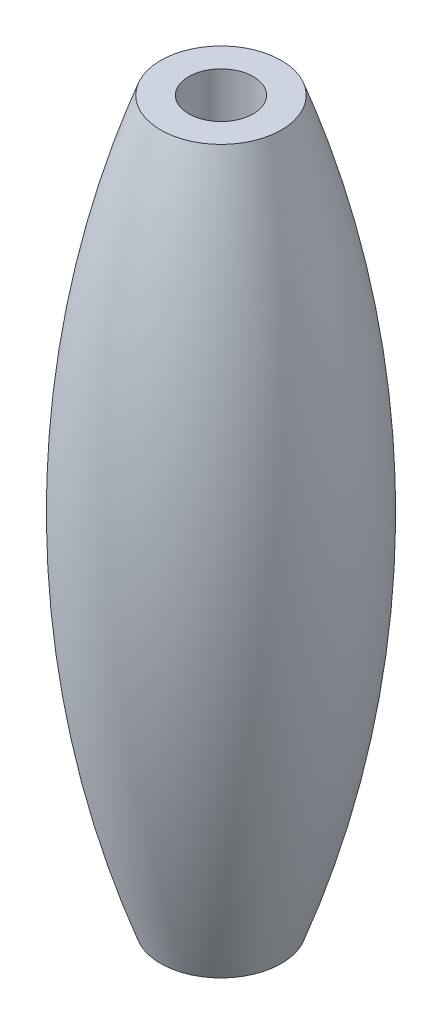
ISO-10303-21;
HEADER;
FILE_DESCRIPTION(('STEP AP214'),'2;1');
FILE_NAME('part.step','',(''),(''),'','','');
FILE_SCHEMA(('AUTOMOTIVE_DESIGN { 1 0 10303 214 1 1 1 1 }'));
ENDSEC;
DATA;
#1=APPLICATION_CONTEXT('core data for automotive mechanical design processes');
#2=APPLICATION_PROTOCOL_DEFINITION('international standard','automotive_design',2000,#1);
#3=PRODUCT_CONTEXT('',#1,'mechanical');
#4=PRODUCT('Part','Part','',(#3));
#5=PRODUCT_RELATED_PRODUCT_CATEGORY('part','',(#4));
#6=PRODUCT_DEFINITION_FORMATION('','',#4);
#7=PRODUCT_DEFINITION_CONTEXT('part definition',#1,'design');
#8=PRODUCT_DEFINITION('design','',#6,#7);
#9=PRODUCT_DEFINITION_SHAPE('','',#8);
#10=(LENGTH_UNIT() NAMED_UNIT(*) SI_UNIT(.MILLI.,.METRE.));
#11=(NAMED_UNIT(*) PLANE_ANGLE_UNIT() SI_UNIT($,.RADIAN.));
#12=(NAMED_UNIT(*) SI_UNIT($,.STERADIAN.) SOLID_ANGLE_UNIT());
#13=UNCERTAINTY_MEASURE_WITH_UNIT(LENGTH_MEASURE(1.E-05),#10,'distance_accuracy_value','');
#14=(GEOMETRIC_REPRESENTATION_CONTEXT(3) GLOBAL_UNCERTAINTY_ASSIGNED_CONTEXT((#13)) GLOBAL_UNIT_ASSIGNED_CONTEXT((#10,
#11,#12)) REPRESENTATION_CONTEXT('',''));
#15=CARTESIAN_POINT('',(0.,0.,0.));
#16=DIRECTION('',(0.,0.,1.));
#17=DIRECTION('',(1.,0.,0.));
#18=AXIS2_PLACEMENT_3D('',#15,#16,#17);
#19=CARTESIAN_POINT('',(0.,-19.,0.));
#20=DIRECTION('',(0.,-1.,0.));
#21=DIRECTION('',(0.,0.,-1.));
#22=AXIS2_PLACEMENT_3D('',#19,#20,#21);
#23=PLANE('',#22);
#24=CARTESIAN_POINT('',(0.,-19.,0.));
#25=DIRECTION('',(0.,1.,0.));
#26=DIRECTION('',(0.,0.,1.));
#27=AXIS2_PLACEMENT_3D('',#24,#25,#26);
#28=CIRCLE('',#27,1.69999999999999);
#29=CARTESIAN_POINT('',(0.,-19.,1.69999999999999));
#30=VERTEX_POINT('',#29);
#31=EDGE_CURVE('E44',#30,#30,#28,.T.);
#32=ORIENTED_EDGE('',*,*,#31,.T.);
#33=EDGE_LOOP('',(#32));
#34=FACE_BOUND('',#33,.T.);
#35=CARTESIAN_POINT('',(0.,-19.,0.));
#36=DIRECTION('',(0.,-1.,0.));
#37=DIRECTION('',(0.,0.,-1.));
#38=AXIS2_PLACEMENT_3D('',#35,#36,#37);
#39=CIRCLE('',#38,3.175);
#40=CARTESIAN_POINT('',(0.,-19.,-3.175));
#41=VERTEX_POINT('',#40);
#42=EDGE_CURVE('E36',#41,#41,#39,.T.);
#43=ORIENTED_EDGE('',*,*,#42,.T.);
#44=EDGE_LOOP('',(#43));
#45=FACE_BOUND('',#44,.T.);
#46=ADVANCED_FACE('F30',(#34,#45),#23,.T.);
#47=CARTESIAN_POINT('',(0.,19.,0.));
#48=DIRECTION('',(0.,1.,0.));
#49=DIRECTION('',(0.,0.,1.));
#50=AXIS2_PLACEMENT_3D('',#47,#48,#49);
#51=PLANE('',#50);
#52=CARTESIAN_POINT('',(0.,19.,0.));
#53=DIRECTION('',(0.,1.,0.));
#54=DIRECTION('',(0.,0.,1.));
#55=AXIS2_PLACEMENT_3D('',#52,#53,#54);
#56=CIRCLE('',#55,1.69999999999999);
#57=CARTESIAN_POINT('',(0.,19.,1.69999999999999));
#58=VERTEX_POINT('',#57);
#59=EDGE_CURVE('E40',#58,#58,#56,.T.);
#60=ORIENTED_EDGE('',*,*,#59,.F.);
#61=EDGE_LOOP('',(#60));
#62=FACE_BOUND('',#61,.T.);
#63=CARTESIAN_POINT('',(0.,19.,0.));
#64=DIRECTION('',(0.,-1.,0.));
#65=DIRECTION('',(0.,0.,-1.));
#66=AXIS2_PLACEMENT_3D('',#63,#64,#65);
#67=CIRCLE('',#66,3.175);
#68=CARTESIAN_POINT('',(0.,19.,-3.175));
#69=VERTEX_POINT('',#68);
#70=EDGE_CURVE('E10',#69,#69,#67,.T.);
#71=ORIENTED_EDGE('',*,*,#70,.F.);
#72=EDGE_LOOP('',(#71));
#73=FACE_BOUND('',#72,.T.);
#74=ADVANCED_FACE('F58',(#62,#73),#51,.T.);
#75=CARTESIAN_POINT('',(0.,0.,0.));
#76=DIRECTION('',(0.,-1.,0.));
#77=DIRECTION('',(0.,0.,-1.));
#78=AXIS2_PLACEMENT_3D('',#75,#76,#77);
#79=DEGENERATE_TOROIDAL_SURFACE('',#78,49.4482142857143,55.9482142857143,.F.);
#80=ORIENTED_EDGE('',*,*,#70,.T.);
#81=EDGE_LOOP('',(#80));
#82=FACE_BOUND('',#81,.T.);
#83=ORIENTED_EDGE('',*,*,#42,.F.);
#84=EDGE_LOOP('',(#83));
#85=FACE_BOUND('',#84,.T.);
#86=ADVANCED_FACE('F54',(#82,#85),#79,.F.);
#87=CARTESIAN_POINT('',(0.,19.,0.));
#88=DIRECTION('',(0.,1.,0.));
#89=DIRECTION('',(0.,0.,1.));
#90=AXIS2_PLACEMENT_3D('',#87,#88,#89);
#91=CYLINDRICAL_SURFACE('',#90,1.69999999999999);
#92=ORIENTED_EDGE('',*,*,#31,.F.);
#93=EDGE_LOOP('',(#92));
#94=FACE_BOUND('',#93,.T.);
#95=ORIENTED_EDGE('',*,*,#59,.T.);
#96=EDGE_LOOP('',(#95));
#97=FACE_BOUND('',#96,.T.);
#98=ADVANCED_FACE('F51',(#94,#97),#91,.F.);
#99=CLOSED_SHELL('',(#46,#74,#86,#98));
#100=MANIFOLD_SOLID_BREP('B2',#99);
#101=ADVANCED_BREP_SHAPE_REPRESENTATION('',(#18,#100),#14);
#102=SHAPE_DEFINITION_REPRESENTATION(#9,#101);
ENDSEC;
END-ISO-10303-21;
